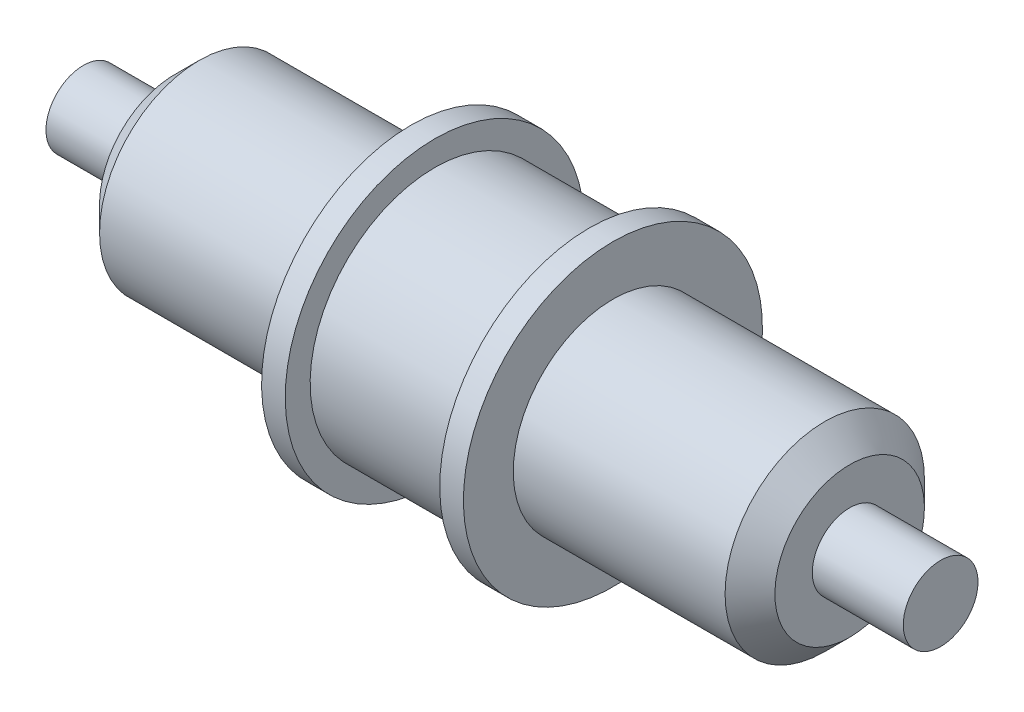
ISO-10303-21;
HEADER;
FILE_DESCRIPTION(('STEP AP214'),'2;1');
FILE_NAME('part.step','',(''),(''),'','','');
FILE_SCHEMA(('AUTOMOTIVE_DESIGN { 1 0 10303 214 1 1 1 1 }'));
ENDSEC;
DATA;
#1=APPLICATION_CONTEXT('core data for automotive mechanical design processes');
#2=APPLICATION_PROTOCOL_DEFINITION('international standard','automotive_design',2000,#1);
#3=PRODUCT_CONTEXT('',#1,'mechanical');
#4=PRODUCT('Part','Part','',(#3));
#5=PRODUCT_RELATED_PRODUCT_CATEGORY('part','',(#4));
#6=PRODUCT_DEFINITION_FORMATION('','',#4);
#7=PRODUCT_DEFINITION_CONTEXT('part definition',#1,'design');
#8=PRODUCT_DEFINITION('design','',#6,#7);
#9=PRODUCT_DEFINITION_SHAPE('','',#8);
#10=(LENGTH_UNIT() NAMED_UNIT(*) SI_UNIT(.MILLI.,.METRE.));
#11=(NAMED_UNIT(*) PLANE_ANGLE_UNIT() SI_UNIT($,.RADIAN.));
#12=(NAMED_UNIT(*) SI_UNIT($,.STERADIAN.) SOLID_ANGLE_UNIT());
#13=UNCERTAINTY_MEASURE_WITH_UNIT(LENGTH_MEASURE(1.E-05),#10,'distance_accuracy_value','');
#14=(GEOMETRIC_REPRESENTATION_CONTEXT(3) GLOBAL_UNCERTAINTY_ASSIGNED_CONTEXT((#13)) GLOBAL_UNIT_ASSIGNED_CONTEXT((#10,
#11,#12)) REPRESENTATION_CONTEXT('',''));
#15=CARTESIAN_POINT('',(0.,0.,0.));
#16=DIRECTION('',(0.,0.,1.));
#17=DIRECTION('',(1.,0.,0.));
#18=AXIS2_PLACEMENT_3D('',#15,#16,#17);
#19=CARTESIAN_POINT('',(-17.2,0.,0.));
#20=DIRECTION('',(-1.,0.,0.));
#21=DIRECTION('',(0.,-1.,0.));
#22=AXIS2_PLACEMENT_3D('',#19,#20,#21);
#23=PLANE('',#22);
#24=CARTESIAN_POINT('',(-17.2,0.,0.));
#25=DIRECTION('',(1.,0.,0.));
#26=DIRECTION('',(0.,1.,0.));
#27=AXIS2_PLACEMENT_3D('',#24,#25,#26);
#28=CIRCLE('',#27,1.5);
#29=CARTESIAN_POINT('',(-17.2,1.5,0.));
#30=VERTEX_POINT('',#29);
#31=EDGE_CURVE('E25',#30,#30,#28,.T.);
#32=ORIENTED_EDGE('',*,*,#31,.F.);
#33=EDGE_LOOP('',(#32));
#34=FACE_BOUND('',#33,.T.);
#35=ADVANCED_FACE('F14',(#34),#23,.T.);
#36=CARTESIAN_POINT('',(0.,0.,0.));
#37=DIRECTION('',(1.,0.,0.));
#38=DIRECTION('',(0.,1.,0.));
#39=AXIS2_PLACEMENT_3D('',#36,#37,#38);
#40=CYLINDRICAL_SURFACE('',#39,1.5);
#41=ORIENTED_EDGE('',*,*,#31,.T.);
#42=EDGE_LOOP('',(#41));
#43=FACE_BOUND('',#42,.T.);
#44=CARTESIAN_POINT('',(-13.55,0.,0.));
#45=DIRECTION('',(1.,0.,0.));
#46=DIRECTION('',(0.,1.,0.));
#47=AXIS2_PLACEMENT_3D('',#44,#45,#46);
#48=CIRCLE('',#47,1.5);
#49=CARTESIAN_POINT('',(-13.55,1.5,0.));
#50=VERTEX_POINT('',#49);
#51=EDGE_CURVE('E29',#50,#50,#48,.T.);
#52=ORIENTED_EDGE('',*,*,#51,.F.);
#53=EDGE_LOOP('',(#52));
#54=FACE_BOUND('',#53,.T.);
#55=ADVANCED_FACE('F90',(#43,#54),#40,.T.);
#56=CARTESIAN_POINT('',(-13.55,1.5,0.));
#57=DIRECTION('',(-1.,0.,0.));
#58=DIRECTION('',(0.,-1.,0.));
#59=AXIS2_PLACEMENT_3D('',#56,#57,#58);
#60=PLANE('',#59);
#61=CARTESIAN_POINT('',(-13.55,0.,0.));
#62=DIRECTION('',(-1.,0.,0.));
#63=DIRECTION('',(0.,-1.,0.));
#64=AXIS2_PLACEMENT_3D('',#61,#62,#63);
#65=CIRCLE('',#64,2.99999999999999);
#66=CARTESIAN_POINT('',(-13.55,-2.99999999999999,0.));
#67=VERTEX_POINT('',#66);
#68=EDGE_CURVE('E9',#67,#67,#65,.T.);
#69=ORIENTED_EDGE('',*,*,#68,.T.);
#70=EDGE_LOOP('',(#69));
#71=FACE_BOUND('',#70,.T.);
#72=ORIENTED_EDGE('',*,*,#51,.T.);
#73=EDGE_LOOP('',(#72));
#74=FACE_BOUND('',#73,.T.);
#75=ADVANCED_FACE('F95',(#71,#74),#60,.T.);
#76=CARTESIAN_POINT('',(0.,0.,0.));
#77=DIRECTION('',(1.,0.,0.));
#78=DIRECTION('',(0.,1.,0.));
#79=AXIS2_PLACEMENT_3D('',#76,#77,#78);
#80=CYLINDRICAL_SURFACE('',#79,4.);
#81=CARTESIAN_POINT('',(-12.55,0.,0.));
#82=DIRECTION('',(-1.,0.,0.));
#83=DIRECTION('',(0.,-1.,0.));
#84=AXIS2_PLACEMENT_3D('',#81,#82,#83);
#85=CIRCLE('',#84,4.);
#86=CARTESIAN_POINT('',(-12.55,-4.,0.));
#87=VERTEX_POINT('',#86);
#88=EDGE_CURVE('E21',#87,#87,#85,.F.);
#89=ORIENTED_EDGE('',*,*,#88,.T.);
#90=EDGE_LOOP('',(#89));
#91=FACE_BOUND('',#90,.T.);
#92=CARTESIAN_POINT('',(-4.05,0.,0.));
#93=DIRECTION('',(1.,0.,0.));
#94=DIRECTION('',(0.,1.,0.));
#95=AXIS2_PLACEMENT_3D('',#92,#93,#94);
#96=CIRCLE('',#95,4.);
#97=CARTESIAN_POINT('',(-4.05,4.,0.));
#98=VERTEX_POINT('',#97);
#99=EDGE_CURVE('E34',#98,#98,#96,.T.);
#100=ORIENTED_EDGE('',*,*,#99,.F.);
#101=EDGE_LOOP('',(#100));
#102=FACE_BOUND('',#101,.T.);
#103=ADVANCED_FACE('F102',(#91,#102),#80,.T.);
#104=CARTESIAN_POINT('',(-4.05,4.,0.));
#105=DIRECTION('',(-1.,0.,0.));
#106=DIRECTION('',(0.,-1.,0.));
#107=AXIS2_PLACEMENT_3D('',#104,#105,#106);
#108=PLANE('',#107);
#109=ORIENTED_EDGE('',*,*,#99,.T.);
#110=EDGE_LOOP('',(#109));
#111=FACE_BOUND('',#110,.T.);
#112=CARTESIAN_POINT('',(-4.05,0.,0.));
#113=DIRECTION('',(1.,0.,0.));
#114=DIRECTION('',(0.,1.,0.));
#115=AXIS2_PLACEMENT_3D('',#112,#113,#114);
#116=CIRCLE('',#115,6.);
#117=CARTESIAN_POINT('',(-4.05,6.,0.));
#118=VERTEX_POINT('',#117);
#119=EDGE_CURVE('E37',#118,#118,#116,.T.);
#120=ORIENTED_EDGE('',*,*,#119,.F.);
#121=EDGE_LOOP('',(#120));
#122=FACE_BOUND('',#121,.T.);
#123=ADVANCED_FACE('F105',(#111,#122),#108,.T.);
#124=CARTESIAN_POINT('',(0.,0.,0.));
#125=DIRECTION('',(1.,0.,0.));
#126=DIRECTION('',(0.,1.,0.));
#127=AXIS2_PLACEMENT_3D('',#124,#125,#126);
#128=CYLINDRICAL_SURFACE('',#127,6.);
#129=ORIENTED_EDGE('',*,*,#119,.T.);
#130=EDGE_LOOP('',(#129));
#131=FACE_BOUND('',#130,.T.);
#132=CARTESIAN_POINT('',(-3.1,0.,0.));
#133=DIRECTION('',(1.,0.,0.));
#134=DIRECTION('',(0.,1.,0.));
#135=AXIS2_PLACEMENT_3D('',#132,#133,#134);
#136=CIRCLE('',#135,6.);
#137=CARTESIAN_POINT('',(-3.1,6.,0.));
#138=VERTEX_POINT('',#137);
#139=EDGE_CURVE('E40',#138,#138,#136,.T.);
#140=ORIENTED_EDGE('',*,*,#139,.F.);
#141=EDGE_LOOP('',(#140));
#142=FACE_BOUND('',#141,.T.);
#143=ADVANCED_FACE('F85',(#131,#142),#128,.T.);
#144=CARTESIAN_POINT('',(-3.1,6.,0.));
#145=DIRECTION('',(1.,0.,0.));
#146=DIRECTION('',(0.,1.,0.));
#147=AXIS2_PLACEMENT_3D('',#144,#145,#146);
#148=PLANE('',#147);
#149=ORIENTED_EDGE('',*,*,#139,.T.);
#150=EDGE_LOOP('',(#149));
#151=FACE_BOUND('',#150,.T.);
#152=CARTESIAN_POINT('',(-3.1,0.,0.));
#153=DIRECTION('',(1.,0.,0.));
#154=DIRECTION('',(0.,1.,0.));
#155=AXIS2_PLACEMENT_3D('',#152,#153,#154);
#156=CIRCLE('',#155,5.);
#157=CARTESIAN_POINT('',(-3.1,5.,0.));
#158=VERTEX_POINT('',#157);
#159=EDGE_CURVE('E43',#158,#158,#156,.T.);
#160=ORIENTED_EDGE('',*,*,#159,.F.);
#161=EDGE_LOOP('',(#160));
#162=FACE_BOUND('',#161,.T.);
#163=ADVANCED_FACE('F75',(#151,#162),#148,.T.);
#164=CARTESIAN_POINT('',(0.,0.,0.));
#165=DIRECTION('',(1.,0.,0.));
#166=DIRECTION('',(0.,1.,0.));
#167=AXIS2_PLACEMENT_3D('',#164,#165,#166);
#168=CYLINDRICAL_SURFACE('',#167,5.);
#169=ORIENTED_EDGE('',*,*,#159,.T.);
#170=EDGE_LOOP('',(#169));
#171=FACE_BOUND('',#170,.T.);
#172=CARTESIAN_POINT('',(3.1,0.,0.));
#173=DIRECTION('',(1.,0.,0.));
#174=DIRECTION('',(0.,1.,0.));
#175=AXIS2_PLACEMENT_3D('',#172,#173,#174);
#176=CIRCLE('',#175,5.);
#177=CARTESIAN_POINT('',(3.1,5.,0.));
#178=VERTEX_POINT('',#177);
#179=EDGE_CURVE('E67',#178,#178,#176,.T.);
#180=ORIENTED_EDGE('',*,*,#179,.F.);
#181=EDGE_LOOP('',(#180));
#182=FACE_BOUND('',#181,.T.);
#183=ADVANCED_FACE('F73',(#171,#182),#168,.T.);
#184=CARTESIAN_POINT('',(-12.55,0.,0.));
#185=DIRECTION('',(1.,0.,0.));
#186=DIRECTION('',(0.,1.,0.));
#187=AXIS2_PLACEMENT_3D('',#184,#185,#186);
#188=CONICAL_SURFACE('',#187,4.,0.785398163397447);
#189=ORIENTED_EDGE('',*,*,#68,.F.);
#190=EDGE_LOOP('',(#189));
#191=FACE_BOUND('',#190,.T.);
#192=ORIENTED_EDGE('',*,*,#88,.F.);
#193=EDGE_LOOP('',(#192));
#194=FACE_BOUND('',#193,.T.);
#195=ADVANCED_FACE('F16',(#191,#194),#188,.T.);
#196=CARTESIAN_POINT('',(17.2,0.,0.));
#197=DIRECTION('',(1.,0.,0.));
#198=DIRECTION('',(0.,-1.,0.));
#199=AXIS2_PLACEMENT_3D('',#196,#197,#198);
#200=PLANE('',#199);
#201=CARTESIAN_POINT('',(17.2,0.,0.));
#202=DIRECTION('',(1.,0.,0.));
#203=DIRECTION('',(0.,1.,0.));
#204=AXIS2_PLACEMENT_3D('',#201,#202,#203);
#205=CIRCLE('',#204,1.5);
#206=CARTESIAN_POINT('',(17.2,1.5,0.));
#207=VERTEX_POINT('',#206);
#208=EDGE_CURVE('E52',#207,#207,#205,.T.);
#209=ORIENTED_EDGE('',*,*,#208,.T.);
#210=EDGE_LOOP('',(#209));
#211=FACE_BOUND('',#210,.T.);
#212=ADVANCED_FACE('F83',(#211),#200,.T.);
#213=CARTESIAN_POINT('',(0.,0.,0.));
#214=DIRECTION('',(-1.,0.,0.));
#215=DIRECTION('',(0.,1.,0.));
#216=AXIS2_PLACEMENT_3D('',#213,#214,#215);
#217=CYLINDRICAL_SURFACE('',#216,1.5);
#218=ORIENTED_EDGE('',*,*,#208,.F.);
#219=EDGE_LOOP('',(#218));
#220=FACE_BOUND('',#219,.T.);
#221=CARTESIAN_POINT('',(13.55,0.,0.));
#222=DIRECTION('',(1.,0.,0.));
#223=DIRECTION('',(0.,1.,0.));
#224=AXIS2_PLACEMENT_3D('',#221,#222,#223);
#225=CIRCLE('',#224,1.5);
#226=CARTESIAN_POINT('',(13.55,1.5,0.));
#227=VERTEX_POINT('',#226);
#228=EDGE_CURVE('E55',#227,#227,#225,.T.);
#229=ORIENTED_EDGE('',*,*,#228,.T.);
#230=EDGE_LOOP('',(#229));
#231=FACE_BOUND('',#230,.T.);
#232=ADVANCED_FACE('F152',(#220,#231),#217,.T.);
#233=CARTESIAN_POINT('',(13.55,1.5,0.));
#234=DIRECTION('',(1.,0.,0.));
#235=DIRECTION('',(0.,-1.,0.));
#236=AXIS2_PLACEMENT_3D('',#233,#234,#235);
#237=PLANE('',#236);
#238=CARTESIAN_POINT('',(13.55,0.,0.));
#239=DIRECTION('',(-1.,0.,0.));
#240=DIRECTION('',(0.,-1.,0.));
#241=AXIS2_PLACEMENT_3D('',#238,#239,#240);
#242=CIRCLE('',#241,2.99999999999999);
#243=CARTESIAN_POINT('',(13.55,-2.99999999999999,0.));
#244=VERTEX_POINT('',#243);
#245=EDGE_CURVE('E46',#244,#244,#242,.T.);
#246=ORIENTED_EDGE('',*,*,#245,.F.);
#247=EDGE_LOOP('',(#246));
#248=FACE_BOUND('',#247,.T.);
#249=ORIENTED_EDGE('',*,*,#228,.F.);
#250=EDGE_LOOP('',(#249));
#251=FACE_BOUND('',#250,.T.);
#252=ADVANCED_FACE('F162',(#248,#251),#237,.T.);
#253=CARTESIAN_POINT('',(0.,0.,0.));
#254=DIRECTION('',(-1.,0.,0.));
#255=DIRECTION('',(0.,1.,0.));
#256=AXIS2_PLACEMENT_3D('',#253,#254,#255);
#257=CYLINDRICAL_SURFACE('',#256,4.);
#258=CARTESIAN_POINT('',(12.55,0.,0.));
#259=DIRECTION('',(-1.,0.,0.));
#260=DIRECTION('',(0.,-1.,0.));
#261=AXIS2_PLACEMENT_3D('',#258,#259,#260);
#262=CIRCLE('',#261,4.);
#263=CARTESIAN_POINT('',(12.55,-4.,0.));
#264=VERTEX_POINT('',#263);
#265=EDGE_CURVE('E49',#264,#264,#262,.F.);
#266=ORIENTED_EDGE('',*,*,#265,.F.);
#267=EDGE_LOOP('',(#266));
#268=FACE_BOUND('',#267,.T.);
#269=CARTESIAN_POINT('',(4.05,0.,0.));
#270=DIRECTION('',(1.,0.,0.));
#271=DIRECTION('',(0.,1.,0.));
#272=AXIS2_PLACEMENT_3D('',#269,#270,#271);
#273=CIRCLE('',#272,4.);
#274=CARTESIAN_POINT('',(4.05,4.,0.));
#275=VERTEX_POINT('',#274);
#276=EDGE_CURVE('E58',#275,#275,#273,.T.);
#277=ORIENTED_EDGE('',*,*,#276,.T.);
#278=EDGE_LOOP('',(#277));
#279=FACE_BOUND('',#278,.T.);
#280=ADVANCED_FACE('F172',(#268,#279),#257,.T.);
#281=CARTESIAN_POINT('',(4.05,4.,0.));
#282=DIRECTION('',(1.,0.,0.));
#283=DIRECTION('',(0.,-1.,0.));
#284=AXIS2_PLACEMENT_3D('',#281,#282,#283);
#285=PLANE('',#284);
#286=ORIENTED_EDGE('',*,*,#276,.F.);
#287=EDGE_LOOP('',(#286));
#288=FACE_BOUND('',#287,.T.);
#289=CARTESIAN_POINT('',(4.05,0.,0.));
#290=DIRECTION('',(1.,0.,0.));
#291=DIRECTION('',(0.,1.,0.));
#292=AXIS2_PLACEMENT_3D('',#289,#290,#291);
#293=CIRCLE('',#292,6.);
#294=CARTESIAN_POINT('',(4.05,6.,0.));
#295=VERTEX_POINT('',#294);
#296=EDGE_CURVE('E61',#295,#295,#293,.T.);
#297=ORIENTED_EDGE('',*,*,#296,.T.);
#298=EDGE_LOOP('',(#297));
#299=FACE_BOUND('',#298,.T.);
#300=ADVANCED_FACE('F182',(#288,#299),#285,.T.);
#301=CARTESIAN_POINT('',(0.,0.,0.));
#302=DIRECTION('',(-1.,0.,0.));
#303=DIRECTION('',(0.,1.,0.));
#304=AXIS2_PLACEMENT_3D('',#301,#302,#303);
#305=CYLINDRICAL_SURFACE('',#304,6.);
#306=ORIENTED_EDGE('',*,*,#296,.F.);
#307=EDGE_LOOP('',(#306));
#308=FACE_BOUND('',#307,.T.);
#309=CARTESIAN_POINT('',(3.1,0.,0.));
#310=DIRECTION('',(1.,0.,0.));
#311=DIRECTION('',(0.,1.,0.));
#312=AXIS2_PLACEMENT_3D('',#309,#310,#311);
#313=CIRCLE('',#312,6.);
#314=CARTESIAN_POINT('',(3.1,6.,0.));
#315=VERTEX_POINT('',#314);
#316=EDGE_CURVE('E64',#315,#315,#313,.T.);
#317=ORIENTED_EDGE('',*,*,#316,.T.);
#318=EDGE_LOOP('',(#317));
#319=FACE_BOUND('',#318,.T.);
#320=ADVANCED_FACE('F192',(#308,#319),#305,.T.);
#321=CARTESIAN_POINT('',(3.1,6.,0.));
#322=DIRECTION('',(-1.,0.,0.));
#323=DIRECTION('',(0.,1.,0.));
#324=AXIS2_PLACEMENT_3D('',#321,#322,#323);
#325=PLANE('',#324);
#326=ORIENTED_EDGE('',*,*,#316,.F.);
#327=EDGE_LOOP('',(#326));
#328=FACE_BOUND('',#327,.T.);
#329=ORIENTED_EDGE('',*,*,#179,.T.);
#330=EDGE_LOOP('',(#329));
#331=FACE_BOUND('',#330,.T.);
#332=ADVANCED_FACE('F71',(#328,#331),#325,.T.);
#333=CARTESIAN_POINT('',(12.55,0.,0.));
#334=DIRECTION('',(-1.,0.,0.));
#335=DIRECTION('',(0.,1.,0.));
#336=AXIS2_PLACEMENT_3D('',#333,#334,#335);
#337=CONICAL_SURFACE('',#336,4.,0.785398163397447);
#338=ORIENTED_EDGE('',*,*,#245,.T.);
#339=EDGE_LOOP('',(#338));
#340=FACE_BOUND('',#339,.T.);
#341=ORIENTED_EDGE('',*,*,#265,.T.);
#342=EDGE_LOOP('',(#341));
#343=FACE_BOUND('',#342,.T.);
#344=ADVANCED_FACE('F211',(#340,#343),#337,.T.);
#345=CLOSED_SHELL('',(#35,#55,#75,#103,#123,#143,#163,#183,#195,#212,#232,#252,#280,#300,#320,
#332,#344));
#346=MANIFOLD_SOLID_BREP('B1',#345);
#347=ADVANCED_BREP_SHAPE_REPRESENTATION('',(#18,#346),#14);
#348=SHAPE_DEFINITION_REPRESENTATION(#9,#347);
ENDSEC;
END-ISO-10303-21;
